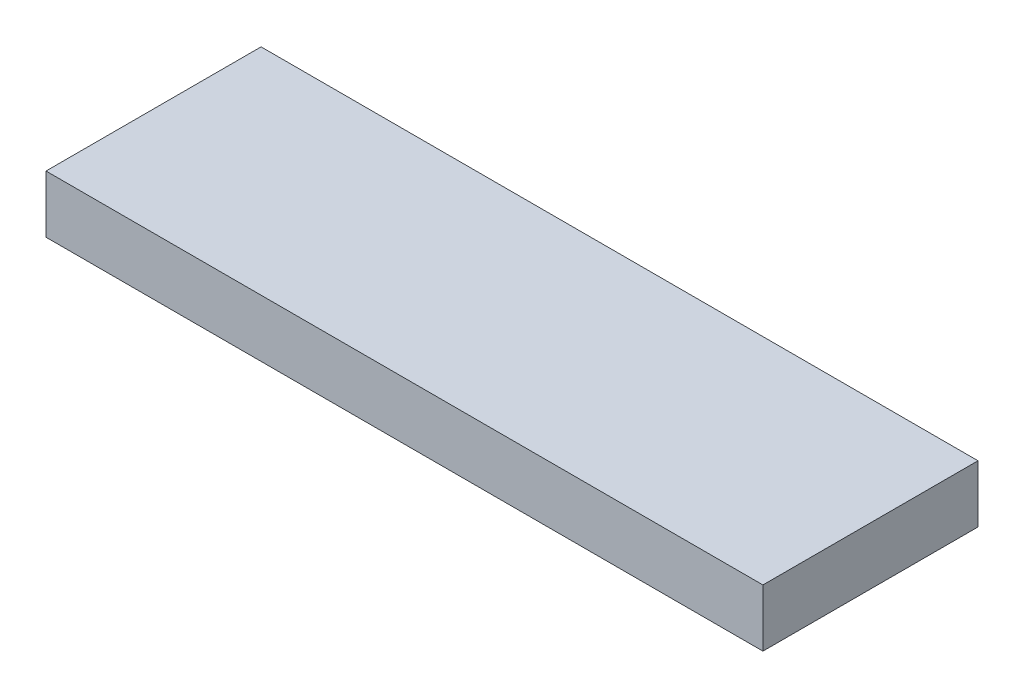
ISO-10303-21;
HEADER;
FILE_DESCRIPTION(('STEP AP214'),'2;1');
FILE_NAME('part.step','',(''),(''),'','','');
FILE_SCHEMA(('AUTOMOTIVE_DESIGN { 1 0 10303 214 1 1 1 1 }'));
ENDSEC;
DATA;
#1=APPLICATION_CONTEXT('core data for automotive mechanical design processes');
#2=APPLICATION_PROTOCOL_DEFINITION('international standard','automotive_design',2000,#1);
#3=PRODUCT_CONTEXT('',#1,'mechanical');
#4=PRODUCT('Part','Part','',(#3));
#5=PRODUCT_RELATED_PRODUCT_CATEGORY('part','',(#4));
#6=PRODUCT_DEFINITION_FORMATION('','',#4);
#7=PRODUCT_DEFINITION_CONTEXT('part definition',#1,'design');
#8=PRODUCT_DEFINITION('design','',#6,#7);
#9=PRODUCT_DEFINITION_SHAPE('','',#8);
#10=(LENGTH_UNIT() NAMED_UNIT(*) SI_UNIT(.MILLI.,.METRE.));
#11=(NAMED_UNIT(*) PLANE_ANGLE_UNIT() SI_UNIT($,.RADIAN.));
#12=(NAMED_UNIT(*) SI_UNIT($,.STERADIAN.) SOLID_ANGLE_UNIT());
#13=UNCERTAINTY_MEASURE_WITH_UNIT(LENGTH_MEASURE(1.E-05),#10,'distance_accuracy_value','');
#14=(GEOMETRIC_REPRESENTATION_CONTEXT(3) GLOBAL_UNCERTAINTY_ASSIGNED_CONTEXT((#13)) GLOBAL_UNIT_ASSIGNED_CONTEXT((#10,
#11,#12)) REPRESENTATION_CONTEXT('',''));
#15=CARTESIAN_POINT('',(0.,0.,0.));
#16=DIRECTION('',(0.,0.,1.));
#17=DIRECTION('',(1.,0.,0.));
#18=AXIS2_PLACEMENT_3D('',#15,#16,#17);
#19=CARTESIAN_POINT('',(50.,4.,15.));
#20=DIRECTION('',(-1.,0.,0.));
#21=DIRECTION('',(0.,0.,1.));
#22=AXIS2_PLACEMENT_3D('',#19,#20,#21);
#23=PLANE('',#22);
#24=DIRECTION('',(0.,0.,-1.));
#25=VECTOR('',#24,1.);
#26=CARTESIAN_POINT('',(50.,-4.,15.));
#27=LINE('',#26,#25);
#28=CARTESIAN_POINT('',(50.,-4.,15.));
#29=VERTEX_POINT('',#28);
#30=CARTESIAN_POINT('',(50.,-4.,-15.));
#31=VERTEX_POINT('',#30);
#32=EDGE_CURVE('E101',#29,#31,#27,.T.);
#33=ORIENTED_EDGE('',*,*,#32,.T.);
#34=DIRECTION('',(0.,-1.,0.));
#35=VECTOR('',#34,1.);
#36=CARTESIAN_POINT('',(50.,4.,-15.));
#37=LINE('',#36,#35);
#38=CARTESIAN_POINT('',(50.,4.,-15.));
#39=VERTEX_POINT('',#38);
#40=EDGE_CURVE('E11',#39,#31,#37,.T.);
#41=ORIENTED_EDGE('',*,*,#40,.F.);
#42=DIRECTION('',(0.,0.,-1.));
#43=VECTOR('',#42,1.);
#44=CARTESIAN_POINT('',(50.,4.,15.));
#45=LINE('',#44,#43);
#46=CARTESIAN_POINT('',(50.,4.,15.));
#47=VERTEX_POINT('',#46);
#48=EDGE_CURVE('E89',#47,#39,#45,.T.);
#49=ORIENTED_EDGE('',*,*,#48,.F.);
#50=DIRECTION('',(0.,-1.,0.));
#51=VECTOR('',#50,1.);
#52=CARTESIAN_POINT('',(50.,4.,15.));
#53=LINE('',#52,#51);
#54=EDGE_CURVE('E97',#47,#29,#53,.T.);
#55=ORIENTED_EDGE('',*,*,#54,.T.);
#56=EDGE_LOOP('',(#33,#41,#49,#55));
#57=FACE_BOUND('',#56,.T.);
#58=ADVANCED_FACE('F38',(#57),#23,.F.);
#59=CARTESIAN_POINT('',(-50.,4.,-15.));
#60=DIRECTION('',(0.,0.,1.));
#61=DIRECTION('',(1.,0.,0.));
#62=AXIS2_PLACEMENT_3D('',#59,#60,#61);
#63=PLANE('',#62);
#64=DIRECTION('',(-1.,0.,0.));
#65=VECTOR('',#64,1.);
#66=CARTESIAN_POINT('',(-50.,-4.,-15.));
#67=LINE('',#66,#65);
#68=CARTESIAN_POINT('',(-50.,-4.,-15.));
#69=VERTEX_POINT('',#68);
#70=EDGE_CURVE('E93',#31,#69,#67,.T.);
#71=ORIENTED_EDGE('',*,*,#70,.T.);
#72=DIRECTION('',(0.,-1.,0.));
#73=VECTOR('',#72,1.);
#74=CARTESIAN_POINT('',(-50.,4.,-15.));
#75=LINE('',#74,#73);
#76=CARTESIAN_POINT('',(-50.,4.,-15.));
#77=VERTEX_POINT('',#76);
#78=EDGE_CURVE('E46',#77,#69,#75,.T.);
#79=ORIENTED_EDGE('',*,*,#78,.F.);
#80=DIRECTION('',(-1.,0.,0.));
#81=VECTOR('',#80,1.);
#82=CARTESIAN_POINT('',(-50.,4.,-15.));
#83=LINE('',#82,#81);
#84=EDGE_CURVE('E84',#39,#77,#83,.T.);
#85=ORIENTED_EDGE('',*,*,#84,.F.);
#86=ORIENTED_EDGE('',*,*,#40,.T.);
#87=EDGE_LOOP('',(#71,#79,#85,#86));
#88=FACE_BOUND('',#87,.T.);
#89=ADVANCED_FACE('F92',(#88),#63,.F.);
#90=CARTESIAN_POINT('',(-50.,4.,15.));
#91=DIRECTION('',(1.,0.,0.));
#92=DIRECTION('',(0.,0.,-1.));
#93=AXIS2_PLACEMENT_3D('',#90,#91,#92);
#94=PLANE('',#93);
#95=DIRECTION('',(0.,0.,1.));
#96=VECTOR('',#95,1.);
#97=CARTESIAN_POINT('',(-50.,-4.,15.));
#98=LINE('',#97,#96);
#99=CARTESIAN_POINT('',(-50.,-4.,15.));
#100=VERTEX_POINT('',#99);
#101=EDGE_CURVE('E71',#69,#100,#98,.T.);
#102=ORIENTED_EDGE('',*,*,#101,.T.);
#103=DIRECTION('',(0.,-1.,0.));
#104=VECTOR('',#103,1.);
#105=CARTESIAN_POINT('',(-50.,4.,15.));
#106=LINE('',#105,#104);
#107=CARTESIAN_POINT('',(-50.,4.,15.));
#108=VERTEX_POINT('',#107);
#109=EDGE_CURVE('E94',#108,#100,#106,.T.);
#110=ORIENTED_EDGE('',*,*,#109,.F.);
#111=DIRECTION('',(0.,0.,1.));
#112=VECTOR('',#111,1.);
#113=CARTESIAN_POINT('',(-50.,4.,15.));
#114=LINE('',#113,#112);
#115=EDGE_CURVE('E87',#77,#108,#114,.T.);
#116=ORIENTED_EDGE('',*,*,#115,.F.);
#117=ORIENTED_EDGE('',*,*,#78,.T.);
#118=EDGE_LOOP('',(#102,#110,#116,#117));
#119=FACE_BOUND('',#118,.T.);
#120=ADVANCED_FACE('F95',(#119),#94,.F.);
#121=CARTESIAN_POINT('',(-50.,4.,15.));
#122=DIRECTION('',(0.,0.,-1.));
#123=DIRECTION('',(-1.,0.,0.));
#124=AXIS2_PLACEMENT_3D('',#121,#122,#123);
#125=PLANE('',#124);
#126=DIRECTION('',(1.,0.,0.));
#127=VECTOR('',#126,1.);
#128=CARTESIAN_POINT('',(-50.,-4.,15.));
#129=LINE('',#128,#127);
#130=EDGE_CURVE('E77',#100,#29,#129,.T.);
#131=ORIENTED_EDGE('',*,*,#130,.T.);
#132=ORIENTED_EDGE('',*,*,#54,.F.);
#133=DIRECTION('',(1.,0.,0.));
#134=VECTOR('',#133,1.);
#135=CARTESIAN_POINT('',(-50.,4.,15.));
#136=LINE('',#135,#134);
#137=EDGE_CURVE('E54',#108,#47,#136,.T.);
#138=ORIENTED_EDGE('',*,*,#137,.F.);
#139=ORIENTED_EDGE('',*,*,#109,.T.);
#140=EDGE_LOOP('',(#131,#132,#138,#139));
#141=FACE_BOUND('',#140,.T.);
#142=ADVANCED_FACE('F108',(#141),#125,.F.);
#143=CARTESIAN_POINT('',(0.,4.,0.));
#144=DIRECTION('',(0.,-1.,0.));
#145=DIRECTION('',(0.,0.,-1.));
#146=AXIS2_PLACEMENT_3D('',#143,#144,#145);
#147=PLANE('',#146);
#148=ORIENTED_EDGE('',*,*,#48,.T.);
#149=ORIENTED_EDGE('',*,*,#84,.T.);
#150=ORIENTED_EDGE('',*,*,#115,.T.);
#151=ORIENTED_EDGE('',*,*,#137,.T.);
#152=EDGE_LOOP('',(#148,#149,#150,#151));
#153=FACE_BOUND('',#152,.T.);
#154=ADVANCED_FACE('F85',(#153),#147,.F.);
#155=CARTESIAN_POINT('',(0.,-4.,0.));
#156=DIRECTION('',(0.,-1.,0.));
#157=DIRECTION('',(0.,0.,-1.));
#158=AXIS2_PLACEMENT_3D('',#155,#156,#157);
#159=PLANE('',#158);
#160=ORIENTED_EDGE('',*,*,#32,.F.);
#161=ORIENTED_EDGE('',*,*,#130,.F.);
#162=ORIENTED_EDGE('',*,*,#101,.F.);
#163=ORIENTED_EDGE('',*,*,#70,.F.);
#164=EDGE_LOOP('',(#160,#161,#162,#163));
#165=FACE_BOUND('',#164,.T.);
#166=ADVANCED_FACE('F111',(#165),#159,.T.);
#167=CLOSED_SHELL('',(#58,#89,#120,#142,#154,#166));
#168=MANIFOLD_SOLID_BREP('B2',#167);
#169=ADVANCED_BREP_SHAPE_REPRESENTATION('',(#18,#168),#14);
#170=SHAPE_DEFINITION_REPRESENTATION(#9,#169);
ENDSEC;
END-ISO-10303-21;
